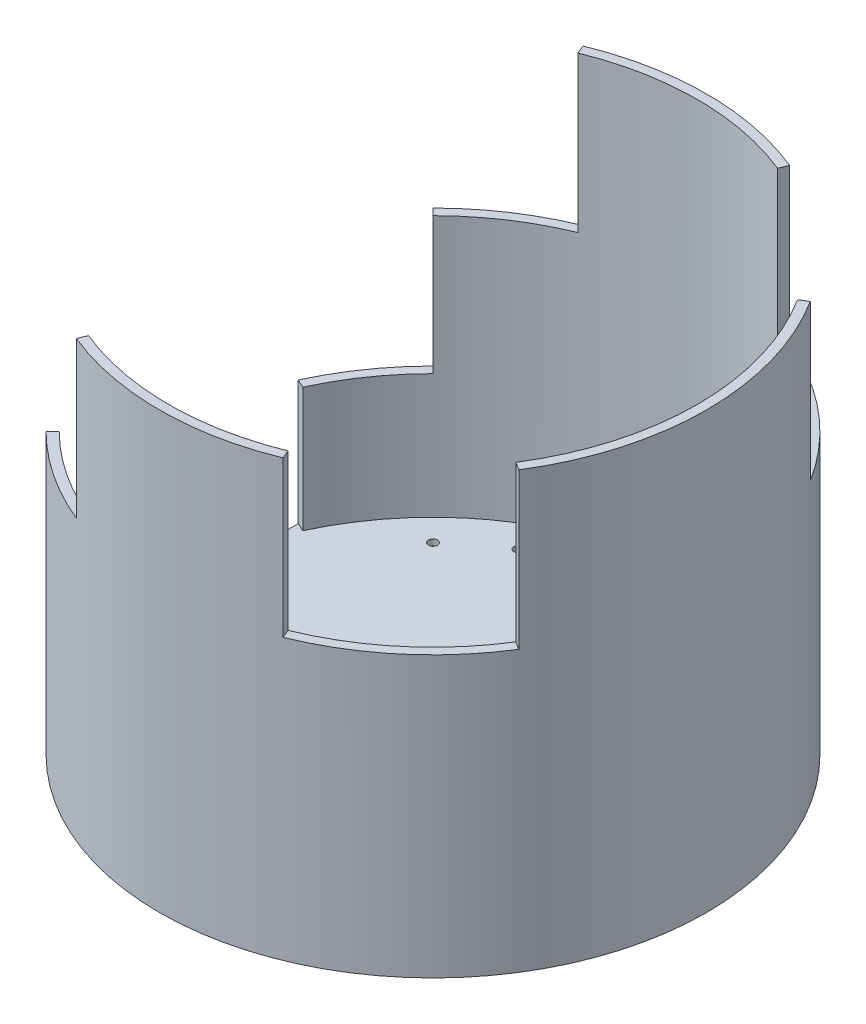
from build123d import *

# Parameters (mm, degrees)
ESBO_O1_R                     = 88
RESSALTO_EXTRUS_O1_DEPTH      = 6
ESBO_O3_R                     = 88
ESBO_O3_R_2                   = 85
RESSALTO_EXTRUS_O2_DEPTH      = 134
CORTE_EXTRUS_O1_DEPTH         = 50
CORTE_EXTRUS_O2_DEPTH         = 188.317911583
RESSALTO_EXTRUS_O3_DEPTH      = 46
CORTE_EXTRUS_O3_DEPTH         = 94
CORTE_EXTRUS_O4_DEPTH         = 94
CORTE_EXTRUS_O5_DEPTH         = 40
CORTE_EXTRUS_O6_DEPTH         = 4
FURO_COM_FOLGA_DE_M2_51_D     = 2.9
FURO_COM_FOLGA_DE_M2_51_DEPTH = 4
FURO_COM_FOLGA_DE_M2_51_TIP   = 0.871247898


with BuildPart() as part:
    # Esbo_o1 → Ressalto-extrus_o1 (new body)
    with BuildSketch(Plane(origin=(0, 0, 0), x_dir=(1, 0, 0), z_dir=(0, 1, 0))):
        with Locations(Location((0, 0, 0), (0, 0, 270))):
            Circle(ESBO_O1_R)
    extrude(amount=RESSALTO_EXTRUS_O1_DEPTH)

    # Esbo_o3 → Ressalto-extrus_o2 (add)
    with BuildSketch(Plane(origin=(0, 6, 0), x_dir=(1, 0, 0), z_dir=(0, 1, 0))):
        with Locations(Location((0, 0, 0), (0, 0, 270))):
            Circle(ESBO_O3_R)
        with Locations(Location((0, 0, 0), (0, 0, 270))):
            Circle(ESBO_O3_R_2, mode=Mode.SUBTRACT)
    extrude(amount=RESSALTO_EXTRUS_O2_DEPTH)

    # Esbo_o4 → Corte-extrus_o1 (cut)
    with BuildSketch(Plane(origin=(0, 140, 0), x_dir=(1, 0, 0), z_dir=(0, 1, 0))):
        Polygon((32.101005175, 78.705307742), (71.935316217, 45.280352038), (78.223516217, 49.238517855), (34.907103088, 85.585304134), align=None)
        Polygon((34.907103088, -85.585304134), (32.101005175, -78.705307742), (71.935316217, -45.280352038), (78.223516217, -49.238517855), align=None)
        Polygon((-32.101005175, -78.705307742), (-71.935316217, -45.280352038), (-78.223516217, -49.238517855), (-34.907103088, -85.585304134), align=None)
        Polygon((-34.907103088, 85.585304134), (-32.101005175, 78.705307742), (-71.935316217, 45.280352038), (-78.223516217, 49.238517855), align=None)
    extrude(amount=-CORTE_EXTRUS_O1_DEPTH, mode=Mode.SUBTRACT)

    # Esbo_o5 → Corte-extrus_o2 (cut, through all)
    with BuildSketch(Plane(origin=(0, 140, 0), x_dir=(1, 0, 0), z_dir=(0, 1, 0))):
        Polygon((-88, -36.66060556), (-88, 36.66060556), (-80, 36.66060556), (-77.272727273, 35.410812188), (-77.272727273, -35.410812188), (-80, -36.66060556), align=None)
    extrude(amount=-CORTE_EXTRUS_O2_DEPTH, mode=Mode.SUBTRACT)

    # Esbo_o6 → Ressalto-extrus_o3 (add)
    with BuildSketch(Plane(origin=(0, 0, 0), x_dir=(1, 0, 0), z_dir=(0, 1, 0))):
        Polygon((-80, 36.66060556), (-77.272727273, 35.410812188), (-77.272727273, -35.410812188), (-80, -36.66060556), align=None)
    extrude(amount=RESSALTO_EXTRUS_O3_DEPTH)

    # Esbo_o7 → Corte-extrus_o3 (cut)
    with BuildSketch(Plane(origin=(0, 140, 0), x_dir=(1, 0, 0), z_dir=(0, 1, 0))):
        Polygon((-74.474209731, 46.87848211), (-71.935316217, 45.280352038), (-71.935316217, -45.280352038), (-74.474209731, -46.87848211), (-80, -46.87848211), (-80, 46.87848211), align=None)
    extrude(amount=-CORTE_EXTRUS_O3_DEPTH, mode=Mode.SUBTRACT)

    # Esbo_o8 → Corte-extrus_o4 (cut)
    with BuildSketch(Plane(origin=(0, 140, 0), x_dir=(1, 0, 0), z_dir=(0, 1, 0))):
        Polygon((-60.104076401, 60.104076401), (-62.225396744, 62.225396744), (-80, 62.225396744), (-80, -62.225396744), (-62.225396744, -62.225396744), (-60.104076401, -60.104076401), align=None)
    extrude(amount=-CORTE_EXTRUS_O4_DEPTH, mode=Mode.SUBTRACT)

    # Esbo_o9 → Corte-extrus_o5 (cut)
    with BuildSketch(Plane(origin=(0, 46, 0), x_dir=(1, 0, 0), z_dir=(0, 1, 0))):
        Polygon((-77.272727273, 35.410812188), (-80, 36.66060556), (-80, -36.66060556), (-77.272727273, -35.410812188), align=None)
    extrude(amount=-CORTE_EXTRUS_O5_DEPTH, mode=Mode.SUBTRACT)

    # Esbo_o10 → Corte-extrus_o6 (cut)
    with BuildSketch(Plane.XZ):
        with BuildLine():
            Line((-55, -64.807406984), (-55, 64.807406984))
            ThreePointArc((-55, 64.807406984), (85, 0), (-55, -64.807406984))
        make_face()
    extrude(amount=-CORTE_EXTRUS_O6_DEPTH, mode=Mode.SUBTRACT)

    # Furo com folga de M2.51
    with Locations(Plane(origin=(-53.033008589, 6, -53.033008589), x_dir=(0, 0, 1), z_dir=(0, 1, 0))):
        with Locations((0, 0), (-11.918896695, 15.533008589), (-11.918896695, 90.533008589), (4.823937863, 110.486341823), (106.066017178, 0), (117.984913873, 15.533008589), (117.984913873, 90.533008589), (101.242079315, 110.486341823)):
            Hole(FURO_COM_FOLGA_DE_M2_51_D / 2, depth=FURO_COM_FOLGA_DE_M2_51_DEPTH)
            with Locations((0, 0, -(FURO_COM_FOLGA_DE_M2_51_DEPTH + FURO_COM_FOLGA_DE_M2_51_TIP / 2))):  # 118° drill point
                Cone(0, FURO_COM_FOLGA_DE_M2_51_D / 2, FURO_COM_FOLGA_DE_M2_51_TIP, mode=Mode.SUBTRACT)


solid = part.part
